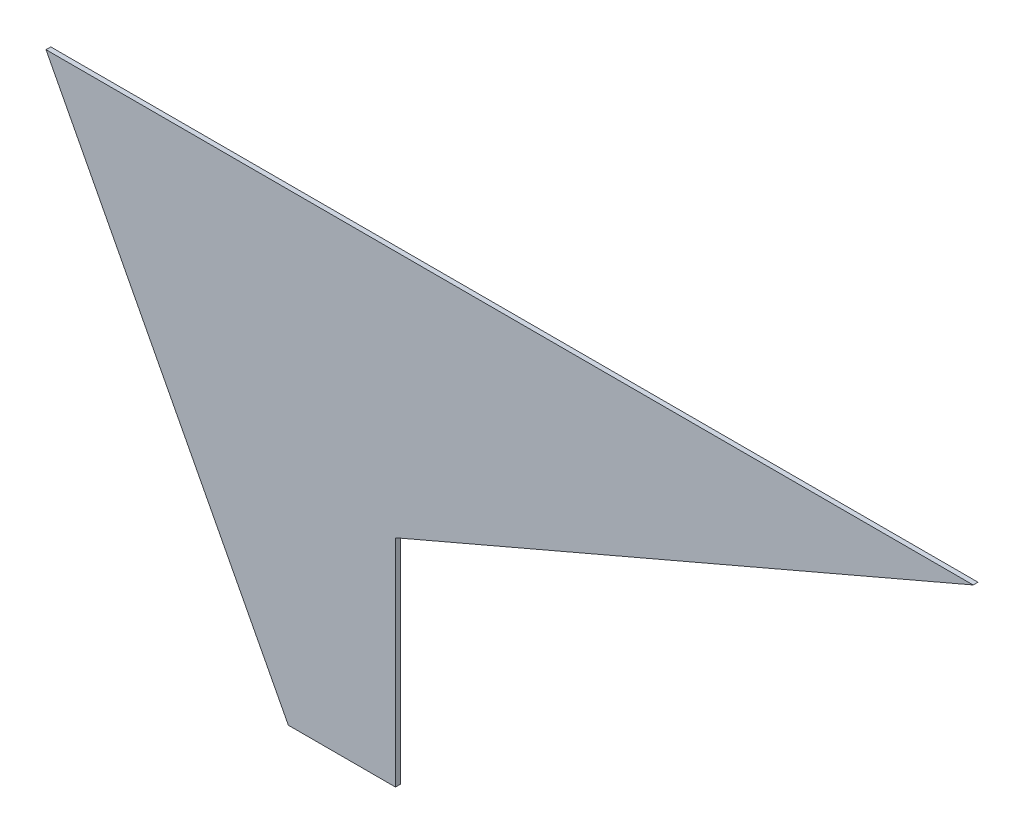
ISO-10303-21;
HEADER;
FILE_DESCRIPTION(('STEP AP214'),'2;1');
FILE_NAME('part.step','',(''),(''),'','','');
FILE_SCHEMA(('AUTOMOTIVE_DESIGN { 1 0 10303 214 1 1 1 1 }'));
ENDSEC;
DATA;
#1=APPLICATION_CONTEXT('core data for automotive mechanical design processes');
#2=APPLICATION_PROTOCOL_DEFINITION('international standard','automotive_design',2000,#1);
#3=PRODUCT_CONTEXT('',#1,'mechanical');
#4=PRODUCT('Part','Part','',(#3));
#5=PRODUCT_RELATED_PRODUCT_CATEGORY('part','',(#4));
#6=PRODUCT_DEFINITION_FORMATION('','',#4);
#7=PRODUCT_DEFINITION_CONTEXT('part definition',#1,'design');
#8=PRODUCT_DEFINITION('design','',#6,#7);
#9=PRODUCT_DEFINITION_SHAPE('','',#8);
#10=(LENGTH_UNIT() NAMED_UNIT(*) SI_UNIT(.MILLI.,.METRE.));
#11=(NAMED_UNIT(*) PLANE_ANGLE_UNIT() SI_UNIT($,.RADIAN.));
#12=(NAMED_UNIT(*) SI_UNIT($,.STERADIAN.) SOLID_ANGLE_UNIT());
#13=UNCERTAINTY_MEASURE_WITH_UNIT(LENGTH_MEASURE(1.E-05),#10,'distance_accuracy_value','');
#14=(GEOMETRIC_REPRESENTATION_CONTEXT(3) GLOBAL_UNCERTAINTY_ASSIGNED_CONTEXT((#13)) GLOBAL_UNIT_ASSIGNED_CONTEXT((#10,
#11,#12)) REPRESENTATION_CONTEXT('',''));
#15=CARTESIAN_POINT('',(0.,0.,0.));
#16=DIRECTION('',(0.,0.,1.));
#17=DIRECTION('',(1.,0.,0.));
#18=AXIS2_PLACEMENT_3D('',#15,#16,#17);
#19=CARTESIAN_POINT('',(33.5,0.,0.));
#20=DIRECTION('',(-1.,0.,0.));
#21=DIRECTION('',(0.,0.,1.));
#22=AXIS2_PLACEMENT_3D('',#19,#20,#21);
#23=PLANE('',#22);
#24=DIRECTION('',(0.,0.,-1.));
#25=VECTOR('',#24,1.);
#26=CARTESIAN_POINT('',(33.5,135.,3.));
#27=LINE('',#26,#25);
#28=CARTESIAN_POINT('',(33.5,135.,3.));
#29=VERTEX_POINT('',#28);
#30=CARTESIAN_POINT('',(33.5,135.,0.));
#31=VERTEX_POINT('',#30);
#32=EDGE_CURVE('E50',#29,#31,#27,.T.);
#33=ORIENTED_EDGE('',*,*,#32,.F.);
#34=DIRECTION('',(0.,-1.,0.));
#35=VECTOR('',#34,1.);
#36=CARTESIAN_POINT('',(33.5,0.,3.));
#37=LINE('',#36,#35);
#38=CARTESIAN_POINT('',(33.5,0.,3.));
#39=VERTEX_POINT('',#38);
#40=EDGE_CURVE('E101',#29,#39,#37,.T.);
#41=ORIENTED_EDGE('',*,*,#40,.T.);
#42=DIRECTION('',(0.,0.,-1.));
#43=VECTOR('',#42,1.);
#44=CARTESIAN_POINT('',(33.5,0.,3.));
#45=LINE('',#44,#43);
#46=CARTESIAN_POINT('',(33.5,0.,0.));
#47=VERTEX_POINT('',#46);
#48=EDGE_CURVE('E43',#39,#47,#45,.T.);
#49=ORIENTED_EDGE('',*,*,#48,.T.);
#50=DIRECTION('',(0.,-1.,0.));
#51=VECTOR('',#50,1.);
#52=CARTESIAN_POINT('',(33.5,0.,0.));
#53=LINE('',#52,#51);
#54=EDGE_CURVE('E98',#31,#47,#53,.T.);
#55=ORIENTED_EDGE('',*,*,#54,.F.);
#56=EDGE_LOOP('',(#33,#41,#49,#55));
#57=FACE_BOUND('',#56,.T.);
#58=ADVANCED_FACE('F35',(#57),#23,.F.);
#59=CARTESIAN_POINT('',(-185.,290.,3.));
#60=DIRECTION('',(0.88633948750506,0.463035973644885,0.));
#61=DIRECTION('',(-0.463035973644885,0.886339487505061,0.));
#62=AXIS2_PLACEMENT_3D('',#59,#60,#61);
#63=PLANE('',#62);
#64=DIRECTION('',(0.463035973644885,-0.886339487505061,0.));
#65=VECTOR('',#64,1.);
#66=CARTESIAN_POINT('',(-185.,290.,0.));
#67=LINE('',#66,#65);
#68=CARTESIAN_POINT('',(-185.,290.,0.));
#69=VERTEX_POINT('',#68);
#70=CARTESIAN_POINT('',(-33.5,0.,0.));
#71=VERTEX_POINT('',#70);
#72=EDGE_CURVE('E94',#69,#71,#67,.T.);
#73=ORIENTED_EDGE('',*,*,#72,.T.);
#74=DIRECTION('',(0.,0.,-1.));
#75=VECTOR('',#74,1.);
#76=CARTESIAN_POINT('',(-33.5,0.,3.));
#77=LINE('',#76,#75);
#78=CARTESIAN_POINT('',(-33.5,0.,3.));
#79=VERTEX_POINT('',#78);
#80=EDGE_CURVE('E11',#79,#71,#77,.T.);
#81=ORIENTED_EDGE('',*,*,#80,.F.);
#82=DIRECTION('',(0.463035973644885,-0.886339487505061,0.));
#83=VECTOR('',#82,1.);
#84=CARTESIAN_POINT('',(-185.,290.,3.));
#85=LINE('',#84,#83);
#86=CARTESIAN_POINT('',(-185.,290.,3.));
#87=VERTEX_POINT('',#86);
#88=EDGE_CURVE('E88',#87,#79,#85,.T.);
#89=ORIENTED_EDGE('',*,*,#88,.F.);
#90=DIRECTION('',(0.,0.,-1.));
#91=VECTOR('',#90,1.);
#92=CARTESIAN_POINT('',(-185.,290.,3.));
#93=LINE('',#92,#91);
#94=EDGE_CURVE('E79',#87,#69,#93,.T.);
#95=ORIENTED_EDGE('',*,*,#94,.T.);
#96=EDGE_LOOP('',(#73,#81,#89,#95));
#97=FACE_BOUND('',#96,.T.);
#98=ADVANCED_FACE('F37',(#97),#63,.F.);
#99=CARTESIAN_POINT('',(-33.5,0.,3.));
#100=DIRECTION('',(0.,1.,0.));
#101=DIRECTION('',(0.,0.,1.));
#102=AXIS2_PLACEMENT_3D('',#99,#100,#101);
#103=PLANE('',#102);
#104=DIRECTION('',(1.,0.,0.));
#105=VECTOR('',#104,1.);
#106=CARTESIAN_POINT('',(-33.5,0.,0.));
#107=LINE('',#106,#105);
#108=EDGE_CURVE('E89',#71,#47,#107,.T.);
#109=ORIENTED_EDGE('',*,*,#108,.T.);
#110=ORIENTED_EDGE('',*,*,#48,.F.);
#111=DIRECTION('',(1.,0.,0.));
#112=VECTOR('',#111,1.);
#113=CARTESIAN_POINT('',(-33.5,0.,3.));
#114=LINE('',#113,#112);
#115=EDGE_CURVE('E111',#79,#39,#114,.T.);
#116=ORIENTED_EDGE('',*,*,#115,.F.);
#117=ORIENTED_EDGE('',*,*,#80,.T.);
#118=EDGE_LOOP('',(#109,#110,#116,#117));
#119=FACE_BOUND('',#118,.T.);
#120=ADVANCED_FACE('F110',(#119),#103,.F.);
#121=CARTESIAN_POINT('',(-185.,290.,3.));
#122=DIRECTION('',(0.,-1.,0.));
#123=DIRECTION('',(0.,0.,-1.));
#124=AXIS2_PLACEMENT_3D('',#121,#122,#123);
#125=PLANE('',#124);
#126=DIRECTION('',(-1.,0.,0.));
#127=VECTOR('',#126,1.);
#128=CARTESIAN_POINT('',(-185.,290.,3.));
#129=LINE('',#128,#127);
#130=CARTESIAN_POINT('',(394.630930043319,290.,3.));
#131=VERTEX_POINT('',#130);
#132=EDGE_CURVE('E59',#131,#87,#129,.T.);
#133=ORIENTED_EDGE('',*,*,#132,.F.);
#134=DIRECTION('',(0.,0.,-1.));
#135=VECTOR('',#134,1.);
#136=CARTESIAN_POINT('',(394.630930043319,290.,3.));
#137=LINE('',#136,#135);
#138=CARTESIAN_POINT('',(394.630930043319,290.,0.));
#139=VERTEX_POINT('',#138);
#140=EDGE_CURVE('E83',#131,#139,#137,.T.);
#141=ORIENTED_EDGE('',*,*,#140,.T.);
#142=DIRECTION('',(-1.,0.,0.));
#143=VECTOR('',#142,1.);
#144=CARTESIAN_POINT('',(-185.,290.,0.));
#145=LINE('',#144,#143);
#146=EDGE_CURVE('E76',#139,#69,#145,.T.);
#147=ORIENTED_EDGE('',*,*,#146,.T.);
#148=ORIENTED_EDGE('',*,*,#94,.F.);
#149=EDGE_LOOP('',(#133,#141,#147,#148));
#150=FACE_BOUND('',#149,.T.);
#151=ADVANCED_FACE('F78',(#150),#125,.F.);
#152=CARTESIAN_POINT('',(0.,0.,3.));
#153=DIRECTION('',(0.,0.,1.));
#154=DIRECTION('',(1.,0.,0.));
#155=AXIS2_PLACEMENT_3D('',#152,#153,#154);
#156=PLANE('',#155);
#157=ORIENTED_EDGE('',*,*,#40,.F.);
#158=DIRECTION('',(0.91893336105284,0.3944128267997,0.));
#159=VECTOR('',#158,1.);
#160=CARTESIAN_POINT('',(33.5,135.,3.));
#161=LINE('',#160,#159);
#162=EDGE_CURVE('E118',#29,#131,#161,.T.);
#163=ORIENTED_EDGE('',*,*,#162,.T.);
#164=ORIENTED_EDGE('',*,*,#132,.T.);
#165=ORIENTED_EDGE('',*,*,#88,.T.);
#166=ORIENTED_EDGE('',*,*,#115,.T.);
#167=EDGE_LOOP('',(#157,#163,#164,#165,#166));
#168=FACE_BOUND('',#167,.T.);
#169=ADVANCED_FACE('F112',(#168),#156,.T.);
#170=CARTESIAN_POINT('',(0.,0.,0.));
#171=DIRECTION('',(0.,0.,1.));
#172=DIRECTION('',(1.,0.,0.));
#173=AXIS2_PLACEMENT_3D('',#170,#171,#172);
#174=PLANE('',#173);
#175=ORIENTED_EDGE('',*,*,#146,.F.);
#176=DIRECTION('',(0.91893336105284,0.3944128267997,0.));
#177=VECTOR('',#176,1.);
#178=CARTESIAN_POINT('',(33.5,135.,0.));
#179=LINE('',#178,#177);
#180=EDGE_CURVE('E119',#31,#139,#179,.T.);
#181=ORIENTED_EDGE('',*,*,#180,.F.);
#182=ORIENTED_EDGE('',*,*,#54,.T.);
#183=ORIENTED_EDGE('',*,*,#108,.F.);
#184=ORIENTED_EDGE('',*,*,#72,.F.);
#185=EDGE_LOOP('',(#175,#181,#182,#183,#184));
#186=FACE_BOUND('',#185,.T.);
#187=ADVANCED_FACE('F96',(#186),#174,.F.);
#188=CARTESIAN_POINT('',(33.5,135.,3.));
#189=DIRECTION('',(-0.3944128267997,0.91893336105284,0.));
#190=DIRECTION('',(-0.91893336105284,-0.3944128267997,0.));
#191=AXIS2_PLACEMENT_3D('',#188,#189,#190);
#192=PLANE('',#191);
#193=ORIENTED_EDGE('',*,*,#180,.T.);
#194=ORIENTED_EDGE('',*,*,#140,.F.);
#195=ORIENTED_EDGE('',*,*,#162,.F.);
#196=ORIENTED_EDGE('',*,*,#32,.T.);
#197=EDGE_LOOP('',(#193,#194,#195,#196));
#198=FACE_BOUND('',#197,.T.);
#199=ADVANCED_FACE('F125',(#198),#192,.F.);
#200=CLOSED_SHELL('',(#58,#98,#120,#151,#169,#187,#199));
#201=MANIFOLD_SOLID_BREP('B2',#200);
#202=ADVANCED_BREP_SHAPE_REPRESENTATION('',(#18,#201),#14);
#203=SHAPE_DEFINITION_REPRESENTATION(#9,#202);
ENDSEC;
END-ISO-10303-21;
